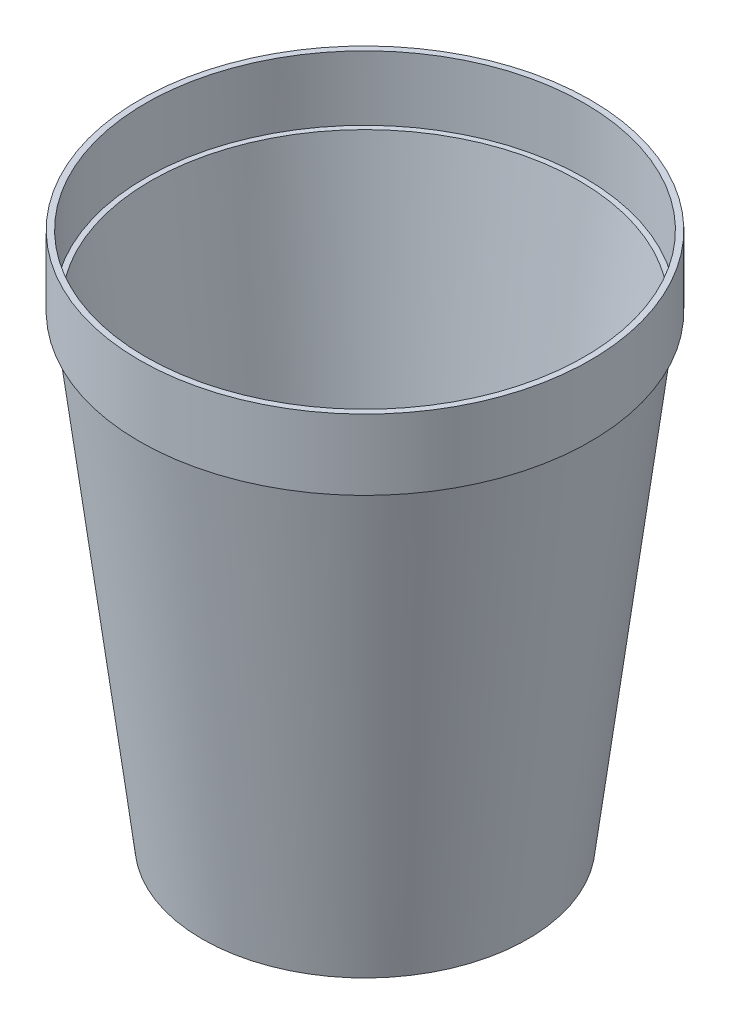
from build123d import *

# Parameters (mm, degrees)
SHELL1_T = -2


with BuildPart() as part:
    # Sketch3 → Revolve1 (revolve)
    with BuildSketch(Plane.XY, mode=Mode.PRIVATE) as revolve1_sk:
        Polygon((0, 0), (0, 180), (76.17850731, 180), (76.17850731, 156.196407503), (74.17850731, 156.196407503), (55, 0), align=None)
    revolve(revolve1_sk.sketch.rotate(Axis((0, 0, 0), (0, 1, 0)), 90), axis=Axis((0, 0, 0), (0, 1, 0)))

    # Shell1
    shell1_openings = [part.faces().sort_by_distance(p)[0] for p in [
        (0, 180, 0),
    ]]
    offset(amount=SHELL1_T, openings=shell1_openings, kind=Kind.INTERSECTION)


solid = part.part
